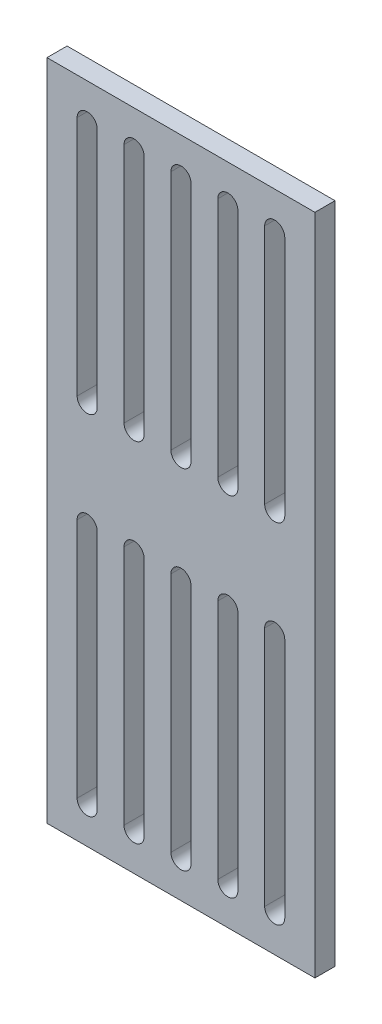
from build123d import *

# Parameters (mm, degrees)
SKETCH1_W            = 254
SKETCH1_H            = 628.65
BOSS_EXTRUDE1_DEPTH  = 19.05
CUT_EXTRUDE1_DEPTH   = 340.546915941
LPATTERN1_COUNT      = 3
LPATTERN1_PITCH      = 44.45
LPATTERN1_COL_COUNT  = 3
LPATTERN1_COL_PITCH  = 44.45
MIRROR1_COPY_1_DEPTH = 340.546915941
MIRROR1_COPY_2_DEPTH = 340.546915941
MIRROR1_COPY_3_DEPTH = 340.546915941
MIRROR1_COPY_4_DEPTH = 340.546915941


with BuildPart() as part:
    # Sketch1 → Boss-Extrude1 (new body)
    with BuildSketch(Plane.XY):
        Rectangle(SKETCH1_W, SKETCH1_H)
    extrude(amount=BOSS_EXTRUDE1_DEPTH)

    # Sketch2 → Cut-Extrude1 (cut, symmetric)
    with BuildSketch(Plane.XY.offset(19.05)):
        with BuildLine():
            Line((9.525, 279.4), (9.525, 50.8))
            ThreePointArc((9.525, 50.8), (0, 41.275), (-9.525, 50.8))
            Line((-9.525, 50.8), (-9.525, 279.4))
            ThreePointArc((-9.525, 279.4), (0, 288.925), (9.525, 279.4))
        make_face()
    cut_extrude1 = extrude(amount=CUT_EXTRUDE1_DEPTH, both=True, mode=Mode.SUBTRACT)

    # LPattern1: Cut-Extrude1 ×3
    with Locations(*[(i * LPATTERN1_PITCH, 0, 0) for i in range(1, LPATTERN1_COUNT)]):
        add(cut_extrude1, mode=Mode.SUBTRACT)

    # LPattern1 col: Cut-Extrude1 ×3
    with Locations(*[(-i * LPATTERN1_COL_PITCH, 0, 0) for i in range(1, LPATTERN1_COL_COUNT)]):
        add(cut_extrude1, mode=Mode.SUBTRACT)

    # Mirror1: Cut-Extrude1 across plane
    add(cut_extrude1.mirror(Plane.ZX), mode=Mode.SUBTRACT)

    # Mirror1 copy 1 sketch → Mirror1 copy 1 (cut, symmetric)
    with BuildSketch(Plane(origin=(44.45, 0, 19.05), x_dir=(1, 0, 0), z_dir=(0, 0, 1))):
        with BuildLine():
            Line((9.525, -279.4), (9.525, -50.8))
            ThreePointArc((9.525, -50.8), (0, -41.275), (-9.525, -50.8))
            Line((-9.525, -50.8), (-9.525, -279.4))
            ThreePointArc((-9.525, -279.4), (0, -288.925), (9.525, -279.4))
        make_face()
    extrude(amount=MIRROR1_COPY_1_DEPTH, both=True, mode=Mode.SUBTRACT)

    # Mirror1 copy 2 sketch → Mirror1 copy 2 (cut, symmetric)
    with BuildSketch(Plane(origin=(88.9, 0, 19.05), x_dir=(1, 0, 0), z_dir=(0, 0, 1))):
        with BuildLine():
            Line((9.525, -279.4), (9.525, -50.8))
            ThreePointArc((9.525, -50.8), (0, -41.275), (-9.525, -50.8))
            Line((-9.525, -50.8), (-9.525, -279.4))
            ThreePointArc((-9.525, -279.4), (0, -288.925), (9.525, -279.4))
        make_face()
    extrude(amount=MIRROR1_COPY_2_DEPTH, both=True, mode=Mode.SUBTRACT)

    # Mirror1 copy 3 sketch → Mirror1 copy 3 (cut, symmetric)
    with BuildSketch(Plane(origin=(-44.45, 0, 19.05), x_dir=(1, 0, 0), z_dir=(0, 0, 1))):
        with BuildLine():
            Line((9.525, -279.4), (9.525, -50.8))
            ThreePointArc((9.525, -50.8), (0, -41.275), (-9.525, -50.8))
            Line((-9.525, -50.8), (-9.525, -279.4))
            ThreePointArc((-9.525, -279.4), (0, -288.925), (9.525, -279.4))
        make_face()
    extrude(amount=MIRROR1_COPY_3_DEPTH, both=True, mode=Mode.SUBTRACT)

    # Mirror1 copy 4 sketch → Mirror1 copy 4 (cut, symmetric)
    with BuildSketch(Plane(origin=(-88.9, 0, 19.05), x_dir=(1, 0, 0), z_dir=(0, 0, 1))):
        with BuildLine():
            Line((9.525, -279.4), (9.525, -50.8))
            ThreePointArc((9.525, -50.8), (0, -41.275), (-9.525, -50.8))
            Line((-9.525, -50.8), (-9.525, -279.4))
            ThreePointArc((-9.525, -279.4), (0, -288.925), (9.525, -279.4))
        make_face()
    extrude(amount=MIRROR1_COPY_4_DEPTH, both=True, mode=Mode.SUBTRACT)


solid = part.part
